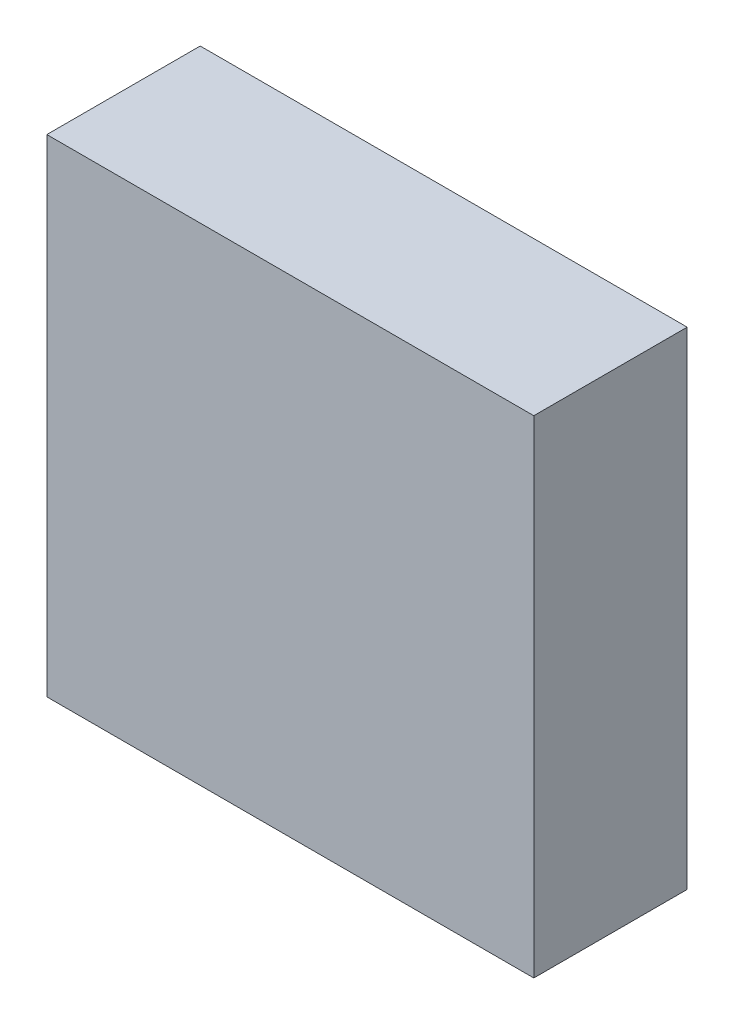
ISO-10303-21;
HEADER;
FILE_DESCRIPTION(('STEP AP214'),'2;1');
FILE_NAME('part.step','',(''),(''),'','','');
FILE_SCHEMA(('AUTOMOTIVE_DESIGN { 1 0 10303 214 1 1 1 1 }'));
ENDSEC;
DATA;
#1=APPLICATION_CONTEXT('core data for automotive mechanical design processes');
#2=APPLICATION_PROTOCOL_DEFINITION('international standard','automotive_design',2000,#1);
#3=PRODUCT_CONTEXT('',#1,'mechanical');
#4=PRODUCT('Part','Part','',(#3));
#5=PRODUCT_RELATED_PRODUCT_CATEGORY('part','',(#4));
#6=PRODUCT_DEFINITION_FORMATION('','',#4);
#7=PRODUCT_DEFINITION_CONTEXT('part definition',#1,'design');
#8=PRODUCT_DEFINITION('design','',#6,#7);
#9=PRODUCT_DEFINITION_SHAPE('','',#8);
#10=(LENGTH_UNIT() NAMED_UNIT(*) SI_UNIT(.MILLI.,.METRE.));
#11=(NAMED_UNIT(*) PLANE_ANGLE_UNIT() SI_UNIT($,.RADIAN.));
#12=(NAMED_UNIT(*) SI_UNIT($,.STERADIAN.) SOLID_ANGLE_UNIT());
#13=UNCERTAINTY_MEASURE_WITH_UNIT(LENGTH_MEASURE(1.E-05),#10,'distance_accuracy_value','');
#14=(GEOMETRIC_REPRESENTATION_CONTEXT(3) GLOBAL_UNCERTAINTY_ASSIGNED_CONTEXT((#13)) GLOBAL_UNIT_ASSIGNED_CONTEXT((#10,
#11,#12)) REPRESENTATION_CONTEXT('',''));
#15=CARTESIAN_POINT('',(0.,0.,0.));
#16=DIRECTION('',(0.,0.,1.));
#17=DIRECTION('',(1.,0.,0.));
#18=AXIS2_PLACEMENT_3D('',#15,#16,#17);
#19=CARTESIAN_POINT('',(0.,0.,0.3999992));
#20=DIRECTION('',(0.,0.,1.));
#21=DIRECTION('',(1.,0.,0.));
#22=AXIS2_PLACEMENT_3D('',#19,#20,#21);
#23=PLANE('',#22);
#24=DIRECTION('',(-1.,0.,0.));
#25=VECTOR('',#24,1.);
#26=CARTESIAN_POINT('',(0.635,0.635,0.3999992));
#27=LINE('',#26,#25);
#28=CARTESIAN_POINT('',(0.635,0.635,0.3999992));
#29=VERTEX_POINT('',#28);
#30=CARTESIAN_POINT('',(-0.635,0.635,0.3999992));
#31=VERTEX_POINT('',#30);
#32=EDGE_CURVE('E99',#29,#31,#27,.T.);
#33=ORIENTED_EDGE('',*,*,#32,.T.);
#34=DIRECTION('',(0.,-1.,0.));
#35=VECTOR('',#34,1.);
#36=CARTESIAN_POINT('',(-0.635,0.635,0.3999992));
#37=LINE('',#36,#35);
#38=CARTESIAN_POINT('',(-0.635,-0.635,0.3999992));
#39=VERTEX_POINT('',#38);
#40=EDGE_CURVE('E78',#31,#39,#37,.T.);
#41=ORIENTED_EDGE('',*,*,#40,.T.);
#42=DIRECTION('',(1.,0.,0.));
#43=VECTOR('',#42,1.);
#44=CARTESIAN_POINT('',(-0.635,-0.635,0.3999992));
#45=LINE('',#44,#43);
#46=CARTESIAN_POINT('',(0.635,-0.635,0.3999992));
#47=VERTEX_POINT('',#46);
#48=EDGE_CURVE('E83',#39,#47,#45,.T.);
#49=ORIENTED_EDGE('',*,*,#48,.T.);
#50=DIRECTION('',(0.,1.,0.));
#51=VECTOR('',#50,1.);
#52=CARTESIAN_POINT('',(0.635,-0.635,0.3999992));
#53=LINE('',#52,#51);
#54=EDGE_CURVE('E11',#47,#29,#53,.T.);
#55=ORIENTED_EDGE('',*,*,#54,.T.);
#56=EDGE_LOOP('',(#33,#41,#49,#55));
#57=FACE_BOUND('',#56,.T.);
#58=ADVANCED_FACE('F17',(#57),#23,.T.);
#59=CARTESIAN_POINT('',(0.,0.,0.));
#60=DIRECTION('',(0.,0.,1.));
#61=DIRECTION('',(1.,0.,0.));
#62=AXIS2_PLACEMENT_3D('',#59,#60,#61);
#63=PLANE('',#62);
#64=DIRECTION('',(0.,1.,0.));
#65=VECTOR('',#64,1.);
#66=CARTESIAN_POINT('',(0.635,-0.635,0.));
#67=LINE('',#66,#65);
#68=CARTESIAN_POINT('',(0.635,-0.635,0.));
#69=VERTEX_POINT('',#68);
#70=CARTESIAN_POINT('',(0.635,0.635,0.));
#71=VERTEX_POINT('',#70);
#72=EDGE_CURVE('E20',#69,#71,#67,.T.);
#73=ORIENTED_EDGE('',*,*,#72,.F.);
#74=DIRECTION('',(1.,0.,0.));
#75=VECTOR('',#74,1.);
#76=CARTESIAN_POINT('',(-0.635,-0.635,0.));
#77=LINE('',#76,#75);
#78=CARTESIAN_POINT('',(-0.635,-0.635,0.));
#79=VERTEX_POINT('',#78);
#80=EDGE_CURVE('E68',#79,#69,#77,.T.);
#81=ORIENTED_EDGE('',*,*,#80,.F.);
#82=DIRECTION('',(0.,-1.,0.));
#83=VECTOR('',#82,1.);
#84=CARTESIAN_POINT('',(-0.635,0.635,0.));
#85=LINE('',#84,#83);
#86=CARTESIAN_POINT('',(-0.635,0.635,0.));
#87=VERTEX_POINT('',#86);
#88=EDGE_CURVE('E72',#87,#79,#85,.T.);
#89=ORIENTED_EDGE('',*,*,#88,.F.);
#90=DIRECTION('',(-1.,0.,0.));
#91=VECTOR('',#90,1.);
#92=CARTESIAN_POINT('',(0.635,0.635,0.));
#93=LINE('',#92,#91);
#94=EDGE_CURVE('E119',#71,#87,#93,.T.);
#95=ORIENTED_EDGE('',*,*,#94,.F.);
#96=EDGE_LOOP('',(#73,#81,#89,#95));
#97=FACE_BOUND('',#96,.T.);
#98=ADVANCED_FACE('F70',(#97),#63,.F.);
#99=CARTESIAN_POINT('',(0.635,-0.635,0.));
#100=DIRECTION('',(-1.,0.,0.));
#101=DIRECTION('',(0.,0.,1.));
#102=AXIS2_PLACEMENT_3D('',#99,#100,#101);
#103=PLANE('',#102);
#104=ORIENTED_EDGE('',*,*,#72,.T.);
#105=DIRECTION('',(0.,0.,1.));
#106=VECTOR('',#105,1.);
#107=CARTESIAN_POINT('',(0.635,0.635,0.));
#108=LINE('',#107,#106);
#109=EDGE_CURVE('E93',#71,#29,#108,.T.);
#110=ORIENTED_EDGE('',*,*,#109,.T.);
#111=ORIENTED_EDGE('',*,*,#54,.F.);
#112=DIRECTION('',(0.,0.,1.));
#113=VECTOR('',#112,1.);
#114=CARTESIAN_POINT('',(0.635,-0.635,0.));
#115=LINE('',#114,#113);
#116=EDGE_CURVE('E77',#69,#47,#115,.T.);
#117=ORIENTED_EDGE('',*,*,#116,.F.);
#118=EDGE_LOOP('',(#104,#110,#111,#117));
#119=FACE_BOUND('',#118,.T.);
#120=ADVANCED_FACE('F115',(#119),#103,.F.);
#121=CARTESIAN_POINT('',(-0.635,-0.635,0.));
#122=DIRECTION('',(0.,1.,0.));
#123=DIRECTION('',(1.,0.,0.));
#124=AXIS2_PLACEMENT_3D('',#121,#122,#123);
#125=PLANE('',#124);
#126=ORIENTED_EDGE('',*,*,#80,.T.);
#127=ORIENTED_EDGE('',*,*,#116,.T.);
#128=ORIENTED_EDGE('',*,*,#48,.F.);
#129=DIRECTION('',(0.,0.,1.));
#130=VECTOR('',#129,1.);
#131=CARTESIAN_POINT('',(-0.635,-0.635,0.));
#132=LINE('',#131,#130);
#133=EDGE_CURVE('E81',#79,#39,#132,.T.);
#134=ORIENTED_EDGE('',*,*,#133,.F.);
#135=EDGE_LOOP('',(#126,#127,#128,#134));
#136=FACE_BOUND('',#135,.T.);
#137=ADVANCED_FACE('F82',(#136),#125,.F.);
#138=CARTESIAN_POINT('',(-0.635,0.635,0.));
#139=DIRECTION('',(1.,0.,0.));
#140=DIRECTION('',(0.,1.,0.));
#141=AXIS2_PLACEMENT_3D('',#138,#139,#140);
#142=PLANE('',#141);
#143=ORIENTED_EDGE('',*,*,#88,.T.);
#144=ORIENTED_EDGE('',*,*,#133,.T.);
#145=ORIENTED_EDGE('',*,*,#40,.F.);
#146=DIRECTION('',(0.,0.,1.));
#147=VECTOR('',#146,1.);
#148=CARTESIAN_POINT('',(-0.635,0.635,0.));
#149=LINE('',#148,#147);
#150=EDGE_CURVE('E90',#87,#31,#149,.T.);
#151=ORIENTED_EDGE('',*,*,#150,.F.);
#152=EDGE_LOOP('',(#143,#144,#145,#151));
#153=FACE_BOUND('',#152,.T.);
#154=ADVANCED_FACE('F88',(#153),#142,.F.);
#155=CARTESIAN_POINT('',(0.635,0.635,0.));
#156=DIRECTION('',(0.,-1.,0.));
#157=DIRECTION('',(0.,0.,-1.));
#158=AXIS2_PLACEMENT_3D('',#155,#156,#157);
#159=PLANE('',#158);
#160=ORIENTED_EDGE('',*,*,#94,.T.);
#161=ORIENTED_EDGE('',*,*,#150,.T.);
#162=ORIENTED_EDGE('',*,*,#32,.F.);
#163=ORIENTED_EDGE('',*,*,#109,.F.);
#164=EDGE_LOOP('',(#160,#161,#162,#163));
#165=FACE_BOUND('',#164,.T.);
#166=ADVANCED_FACE('F118',(#165),#159,.F.);
#167=CLOSED_SHELL('',(#58,#98,#120,#137,#154,#166));
#168=MANIFOLD_SOLID_BREP('B1',#167);
#169=ADVANCED_BREP_SHAPE_REPRESENTATION('',(#18,#168),#14);
#170=SHAPE_DEFINITION_REPRESENTATION(#9,#169);
ENDSEC;
END-ISO-10303-21;
